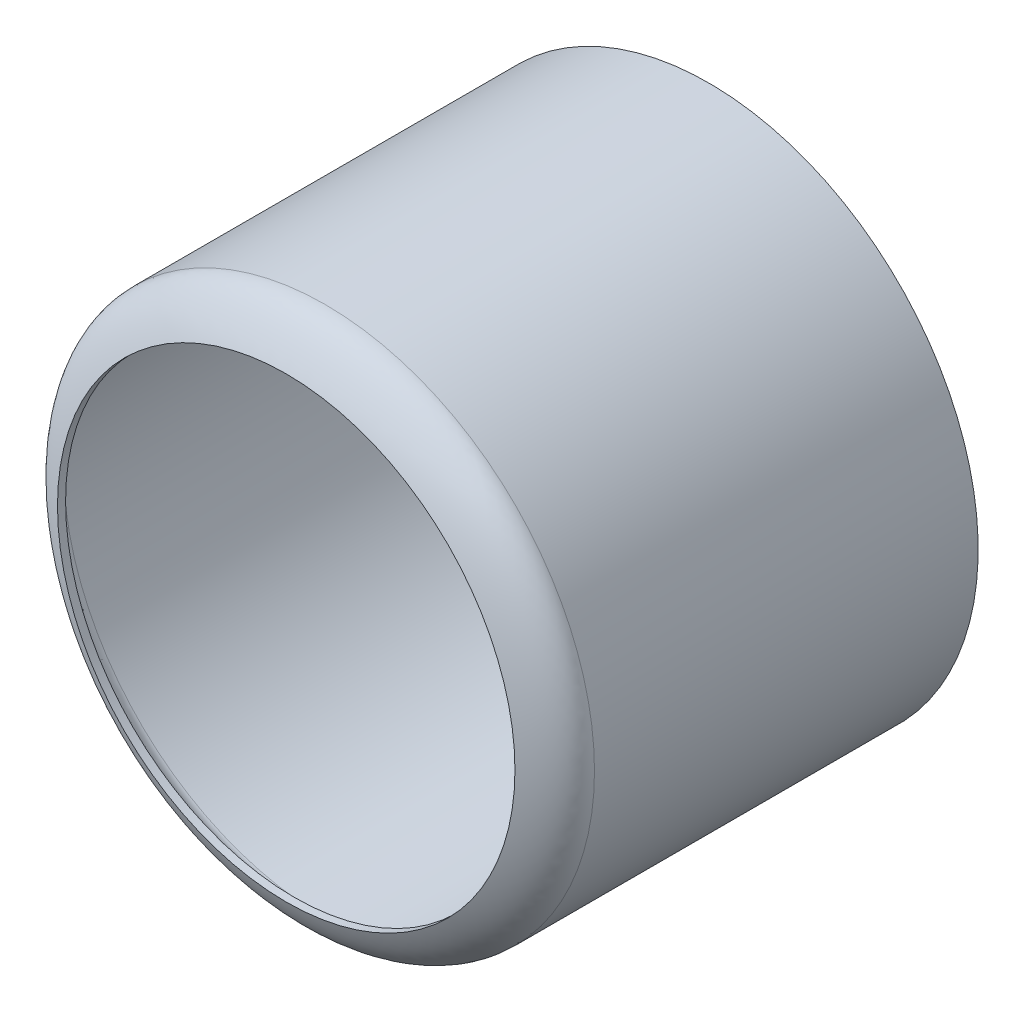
ISO-10303-21;
HEADER;
FILE_DESCRIPTION(('STEP AP214'),'2;1');
FILE_NAME('part.step','',(''),(''),'','','');
FILE_SCHEMA(('AUTOMOTIVE_DESIGN { 1 0 10303 214 1 1 1 1 }'));
ENDSEC;
DATA;
#1=APPLICATION_CONTEXT('core data for automotive mechanical design processes');
#2=APPLICATION_PROTOCOL_DEFINITION('international standard','automotive_design',2000,#1);
#3=PRODUCT_CONTEXT('',#1,'mechanical');
#4=PRODUCT('Part','Part','',(#3));
#5=PRODUCT_RELATED_PRODUCT_CATEGORY('part','',(#4));
#6=PRODUCT_DEFINITION_FORMATION('','',#4);
#7=PRODUCT_DEFINITION_CONTEXT('part definition',#1,'design');
#8=PRODUCT_DEFINITION('design','',#6,#7);
#9=PRODUCT_DEFINITION_SHAPE('','',#8);
#10=(LENGTH_UNIT() NAMED_UNIT(*) SI_UNIT(.MILLI.,.METRE.));
#11=(NAMED_UNIT(*) PLANE_ANGLE_UNIT() SI_UNIT($,.RADIAN.));
#12=(NAMED_UNIT(*) SI_UNIT($,.STERADIAN.) SOLID_ANGLE_UNIT());
#13=UNCERTAINTY_MEASURE_WITH_UNIT(LENGTH_MEASURE(1.E-05),#10,'distance_accuracy_value','');
#14=(GEOMETRIC_REPRESENTATION_CONTEXT(3) GLOBAL_UNCERTAINTY_ASSIGNED_CONTEXT((#13)) GLOBAL_UNIT_ASSIGNED_CONTEXT((#10,
#11,#12)) REPRESENTATION_CONTEXT('',''));
#15=CARTESIAN_POINT('',(0.,0.,0.));
#16=DIRECTION('',(0.,0.,1.));
#17=DIRECTION('',(1.,0.,0.));
#18=AXIS2_PLACEMENT_3D('',#15,#16,#17);
#19=CARTESIAN_POINT('',(0.,0.,26.));
#20=DIRECTION('',(0.,0.,-1.));
#21=DIRECTION('',(-1.,0.,0.));
#22=AXIS2_PLACEMENT_3D('',#19,#20,#21);
#23=CYLINDRICAL_SURFACE('',#22,18.25);
#24=CARTESIAN_POINT('',(0.,0.,26.));
#25=DIRECTION('',(0.,0.,1.));
#26=DIRECTION('',(1.,0.,0.));
#27=AXIS2_PLACEMENT_3D('',#24,#25,#26);
#28=CIRCLE('',#27,18.25);
#29=CARTESIAN_POINT('',(-18.25,0.,26.));
#30=VERTEX_POINT('',#29);
#31=EDGE_CURVE('E10',#30,#30,#28,.T.);
#32=CARTESIAN_POINT('',(0.,0.,0.));
#33=DIRECTION('',(0.,0.,1.));
#34=DIRECTION('',(1.,0.,0.));
#35=AXIS2_PLACEMENT_3D('',#32,#33,#34);
#36=CIRCLE('',#35,18.25);
#37=CARTESIAN_POINT('',(-18.25,0.,0.));
#38=VERTEX_POINT('',#37);
#39=EDGE_CURVE('E38',#38,#38,#36,.T.);
#40=CARTESIAN_POINT('',(-18.25,0.,26.));
#41=CARTESIAN_POINT('',(-18.25,0.,25.7291666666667));
#42=CARTESIAN_POINT('',(-18.25,0.,25.4583333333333));
#43=CARTESIAN_POINT('',(-18.25,0.,24.9166666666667));
#44=CARTESIAN_POINT('',(-18.25,0.,24.6458333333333));
#45=CARTESIAN_POINT('',(-18.25,0.,24.1041666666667));
#46=CARTESIAN_POINT('',(-18.25,0.,23.8333333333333));
#47=CARTESIAN_POINT('',(-18.25,0.,23.2916666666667));
#48=CARTESIAN_POINT('',(-18.25,0.,23.0208333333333));
#49=CARTESIAN_POINT('',(-18.25,0.,22.4791666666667));
#50=CARTESIAN_POINT('',(-18.25,0.,22.2083333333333));
#51=CARTESIAN_POINT('',(-18.25,0.,21.6666666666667));
#52=CARTESIAN_POINT('',(-18.25,0.,21.3958333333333));
#53=CARTESIAN_POINT('',(-18.25,0.,20.8541666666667));
#54=CARTESIAN_POINT('',(-18.25,0.,20.5833333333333));
#55=CARTESIAN_POINT('',(-18.25,0.,20.0416666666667));
#56=CARTESIAN_POINT('',(-18.25,0.,19.7708333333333));
#57=CARTESIAN_POINT('',(-18.25,0.,19.2291666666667));
#58=CARTESIAN_POINT('',(-18.25,0.,18.9583333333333));
#59=CARTESIAN_POINT('',(-18.25,0.,18.4166666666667));
#60=CARTESIAN_POINT('',(-18.25,0.,18.1458333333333));
#61=CARTESIAN_POINT('',(-18.25,0.,17.6041666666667));
#62=CARTESIAN_POINT('',(-18.25,0.,17.3333333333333));
#63=CARTESIAN_POINT('',(-18.25,0.,16.7916666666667));
#64=CARTESIAN_POINT('',(-18.25,0.,16.5208333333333));
#65=CARTESIAN_POINT('',(-18.25,0.,15.9791666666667));
#66=CARTESIAN_POINT('',(-18.25,0.,15.7083333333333));
#67=CARTESIAN_POINT('',(-18.25,0.,15.1666666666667));
#68=CARTESIAN_POINT('',(-18.25,0.,14.8958333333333));
#69=CARTESIAN_POINT('',(-18.25,0.,14.3541666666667));
#70=CARTESIAN_POINT('',(-18.25,0.,14.0833333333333));
#71=CARTESIAN_POINT('',(-18.25,0.,13.5416666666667));
#72=CARTESIAN_POINT('',(-18.25,0.,13.2708333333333));
#73=CARTESIAN_POINT('',(-18.25,0.,12.7291666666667));
#74=CARTESIAN_POINT('',(-18.25,0.,12.4583333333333));
#75=CARTESIAN_POINT('',(-18.25,0.,11.9166666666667));
#76=CARTESIAN_POINT('',(-18.25,0.,11.6458333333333));
#77=CARTESIAN_POINT('',(-18.25,0.,11.1041666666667));
#78=CARTESIAN_POINT('',(-18.25,0.,10.8333333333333));
#79=CARTESIAN_POINT('',(-18.25,0.,10.2916666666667));
#80=CARTESIAN_POINT('',(-18.25,0.,10.0208333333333));
#81=CARTESIAN_POINT('',(-18.25,0.,9.47916666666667));
#82=CARTESIAN_POINT('',(-18.25,0.,9.20833333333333));
#83=CARTESIAN_POINT('',(-18.25,0.,8.66666666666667));
#84=CARTESIAN_POINT('',(-18.25,0.,8.39583333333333));
#85=CARTESIAN_POINT('',(-18.25,0.,7.85416666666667));
#86=CARTESIAN_POINT('',(-18.25,0.,7.58333333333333));
#87=CARTESIAN_POINT('',(-18.25,0.,7.04166666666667));
#88=CARTESIAN_POINT('',(-18.25,0.,6.77083333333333));
#89=CARTESIAN_POINT('',(-18.25,0.,6.22916666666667));
#90=CARTESIAN_POINT('',(-18.25,0.,5.95833333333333));
#91=CARTESIAN_POINT('',(-18.25,0.,5.41666666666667));
#92=CARTESIAN_POINT('',(-18.25,0.,5.14583333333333));
#93=CARTESIAN_POINT('',(-18.25,0.,4.60416666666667));
#94=CARTESIAN_POINT('',(-18.25,0.,4.33333333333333));
#95=CARTESIAN_POINT('',(-18.25,0.,3.79166666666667));
#96=CARTESIAN_POINT('',(-18.25,0.,3.52083333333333));
#97=CARTESIAN_POINT('',(-18.25,0.,2.97916666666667));
#98=CARTESIAN_POINT('',(-18.25,0.,2.70833333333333));
#99=CARTESIAN_POINT('',(-18.25,0.,2.16666666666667));
#100=CARTESIAN_POINT('',(-18.25,0.,1.89583333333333));
#101=CARTESIAN_POINT('',(-18.25,0.,1.35416666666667));
#102=CARTESIAN_POINT('',(-18.25,0.,1.08333333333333));
#103=CARTESIAN_POINT('',(-18.25,0.,0.541666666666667));
#104=CARTESIAN_POINT('',(-18.25,0.,0.270833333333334));
#105=CARTESIAN_POINT('',(-18.25,0.,0.));
#106=B_SPLINE_CURVE_WITH_KNOTS('',3,(#40,#41,#42,#43,#44,#45,#46,#47,#48,#49,#50,#51,#52,#53,
#54,#55,#56,#57,#58,#59,#60,#61,#62,#63,#64,#65,#66,#67,#68,#69,#70,#71,#72,#73,#74,#75,#76,#77,
#78,#79,#80,#81,#82,#83,#84,#85,#86,#87,#88,#89,#90,#91,#92,#93,#94,#95,#96,#97,#98,#99,#100,
#101,#102,#103,#104,#105),.UNSPECIFIED.,.F.,.F.,(4,2,2,2,2,2,2,2,2,2,2,2,2,2,2,2,2,2,2,2,2,2,2,
2,2,2,2,2,2,2,2,2,4),(0.,0.812500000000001,1.625,2.4375,3.25,4.0625,4.875,5.6875,6.5,7.3125,
8.125,8.9375,9.75,10.5625,11.375,12.1875,13.,13.8125,14.625,15.4375,16.25,17.0625,17.875,
18.6875,19.5,20.3125,21.125,21.9375,22.75,23.5625,24.375,25.1875,26.),.UNSPECIFIED.);
#107=EDGE_CURVE('BSEAM30',#30,#38,#106,.T.);
#108=ORIENTED_EDGE('',*,*,#31,.F.);
#109=ORIENTED_EDGE('',*,*,#39,.T.);
#110=ORIENTED_EDGE('',*,*,#107,.T.);
#111=ORIENTED_EDGE('',*,*,#107,.F.);
#112=EDGE_LOOP('',(#108,#110,#109,#111));
#113=FACE_BOUND('',#112,.T.);
#114=ADVANCED_FACE('F30',(#113),#23,.T.);
#115=CARTESIAN_POINT('',(0.,0.,26.));
#116=DIRECTION('',(0.,1.,0.));
#117=DIRECTION('',(1.,0.,0.));
#118=AXIS2_PLACEMENT_3D('',#115,#116,#117);
#119=ELLIPSE('',#118,18.25,5.);
#120=TRIMMED_CURVE('',#119,(PARAMETER_VALUE(4.71238898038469)),
(PARAMETER_VALUE(7.85398163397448)),.T.,.PARAMETER.);
#121=CARTESIAN_POINT('',(0.,0.,21.));
#122=DIRECTION('',(0.,0.,1.));
#123=AXIS1_PLACEMENT('',#121,#122);
#124=SURFACE_OF_REVOLUTION('',#120,#123);
#125=CARTESIAN_POINT('',(0.,0.,28.6394313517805));
#126=DIRECTION('',(0.,0.,1.));
#127=DIRECTION('',(1.,0.,0.));
#128=AXIS2_PLACEMENT_3D('',#125,#126,#127);
#129=CIRCLE('',#128,15.5);
#130=CARTESIAN_POINT('',(15.5,0.,28.6394313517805));
#131=VERTEX_POINT('',#130);
#132=EDGE_CURVE('E74',#131,#131,#129,.T.);
#133=ORIENTED_EDGE('',*,*,#132,.F.);
#134=EDGE_LOOP('',(#133));
#135=FACE_BOUND('',#134,.T.);
#136=ORIENTED_EDGE('',*,*,#31,.T.);
#137=EDGE_LOOP('',(#136));
#138=FACE_BOUND('',#137,.T.);
#139=ADVANCED_FACE('F32',(#135,#138),#124,.F.);
#140=CARTESIAN_POINT('',(0.,0.,0.));
#141=DIRECTION('',(0.,0.,1.));
#142=DIRECTION('',(1.,0.,0.));
#143=AXIS2_PLACEMENT_3D('',#140,#141,#142);
#144=PLANE('',#143);
#145=CARTESIAN_POINT('',(0.,0.,0.));
#146=DIRECTION('',(0.,0.,1.));
#147=DIRECTION('',(1.,0.,0.));
#148=AXIS2_PLACEMENT_3D('',#145,#146,#147);
#149=CIRCLE('',#148,17.75);
#150=CARTESIAN_POINT('',(-17.75,0.,0.));
#151=VERTEX_POINT('',#150);
#152=EDGE_CURVE('E49',#151,#151,#149,.T.);
#153=ORIENTED_EDGE('',*,*,#152,.T.);
#154=EDGE_LOOP('',(#153));
#155=FACE_BOUND('',#154,.T.);
#156=ORIENTED_EDGE('',*,*,#39,.F.);
#157=EDGE_LOOP('',(#156));
#158=FACE_BOUND('',#157,.T.);
#159=ADVANCED_FACE('F57',(#155,#158),#144,.F.);
#160=CARTESIAN_POINT('',(0.,0.,26.));
#161=DIRECTION('',(0.,0.,-1.));
#162=DIRECTION('',(-1.,0.,0.));
#163=AXIS2_PLACEMENT_3D('',#160,#161,#162);
#164=CYLINDRICAL_SURFACE('',#163,17.75);
#165=CARTESIAN_POINT('',(0.,0.,26.));
#166=DIRECTION('',(0.,0.,1.));
#167=DIRECTION('',(1.,0.,0.));
#168=AXIS2_PLACEMENT_3D('',#165,#166,#167);
#169=CIRCLE('',#168,17.75);
#170=CARTESIAN_POINT('',(-17.75,0.,26.));
#171=VERTEX_POINT('',#170);
#172=EDGE_CURVE('E43',#171,#171,#169,.T.);
#173=CARTESIAN_POINT('',(-17.75,0.,26.));
#174=CARTESIAN_POINT('',(-17.75,0.,25.7291666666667));
#175=CARTESIAN_POINT('',(-17.75,0.,25.4583333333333));
#176=CARTESIAN_POINT('',(-17.75,0.,24.9166666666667));
#177=CARTESIAN_POINT('',(-17.75,0.,24.6458333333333));
#178=CARTESIAN_POINT('',(-17.75,0.,24.1041666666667));
#179=CARTESIAN_POINT('',(-17.75,0.,23.8333333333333));
#180=CARTESIAN_POINT('',(-17.75,0.,23.2916666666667));
#181=CARTESIAN_POINT('',(-17.75,0.,23.0208333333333));
#182=CARTESIAN_POINT('',(-17.75,0.,22.4791666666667));
#183=CARTESIAN_POINT('',(-17.75,0.,22.2083333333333));
#184=CARTESIAN_POINT('',(-17.75,0.,21.6666666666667));
#185=CARTESIAN_POINT('',(-17.75,0.,21.3958333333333));
#186=CARTESIAN_POINT('',(-17.75,0.,20.8541666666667));
#187=CARTESIAN_POINT('',(-17.75,0.,20.5833333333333));
#188=CARTESIAN_POINT('',(-17.75,0.,20.0416666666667));
#189=CARTESIAN_POINT('',(-17.75,0.,19.7708333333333));
#190=CARTESIAN_POINT('',(-17.75,0.,19.2291666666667));
#191=CARTESIAN_POINT('',(-17.75,0.,18.9583333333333));
#192=CARTESIAN_POINT('',(-17.75,0.,18.4166666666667));
#193=CARTESIAN_POINT('',(-17.75,0.,18.1458333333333));
#194=CARTESIAN_POINT('',(-17.75,0.,17.6041666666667));
#195=CARTESIAN_POINT('',(-17.75,0.,17.3333333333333));
#196=CARTESIAN_POINT('',(-17.75,0.,16.7916666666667));
#197=CARTESIAN_POINT('',(-17.75,0.,16.5208333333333));
#198=CARTESIAN_POINT('',(-17.75,0.,15.9791666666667));
#199=CARTESIAN_POINT('',(-17.75,0.,15.7083333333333));
#200=CARTESIAN_POINT('',(-17.75,0.,15.1666666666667));
#201=CARTESIAN_POINT('',(-17.75,0.,14.8958333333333));
#202=CARTESIAN_POINT('',(-17.75,0.,14.3541666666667));
#203=CARTESIAN_POINT('',(-17.75,0.,14.0833333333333));
#204=CARTESIAN_POINT('',(-17.75,0.,13.5416666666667));
#205=CARTESIAN_POINT('',(-17.75,0.,13.2708333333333));
#206=CARTESIAN_POINT('',(-17.75,0.,12.7291666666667));
#207=CARTESIAN_POINT('',(-17.75,0.,12.4583333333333));
#208=CARTESIAN_POINT('',(-17.75,0.,11.9166666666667));
#209=CARTESIAN_POINT('',(-17.75,0.,11.6458333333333));
#210=CARTESIAN_POINT('',(-17.75,0.,11.1041666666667));
#211=CARTESIAN_POINT('',(-17.75,0.,10.8333333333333));
#212=CARTESIAN_POINT('',(-17.75,0.,10.2916666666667));
#213=CARTESIAN_POINT('',(-17.75,0.,10.0208333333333));
#214=CARTESIAN_POINT('',(-17.75,0.,9.47916666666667));
#215=CARTESIAN_POINT('',(-17.75,0.,9.20833333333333));
#216=CARTESIAN_POINT('',(-17.75,0.,8.66666666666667));
#217=CARTESIAN_POINT('',(-17.75,0.,8.39583333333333));
#218=CARTESIAN_POINT('',(-17.75,0.,7.85416666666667));
#219=CARTESIAN_POINT('',(-17.75,0.,7.58333333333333));
#220=CARTESIAN_POINT('',(-17.75,0.,7.04166666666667));
#221=CARTESIAN_POINT('',(-17.75,0.,6.77083333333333));
#222=CARTESIAN_POINT('',(-17.75,0.,6.22916666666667));
#223=CARTESIAN_POINT('',(-17.75,0.,5.95833333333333));
#224=CARTESIAN_POINT('',(-17.75,0.,5.41666666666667));
#225=CARTESIAN_POINT('',(-17.75,0.,5.14583333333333));
#226=CARTESIAN_POINT('',(-17.75,0.,4.60416666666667));
#227=CARTESIAN_POINT('',(-17.75,0.,4.33333333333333));
#228=CARTESIAN_POINT('',(-17.75,0.,3.79166666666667));
#229=CARTESIAN_POINT('',(-17.75,0.,3.52083333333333));
#230=CARTESIAN_POINT('',(-17.75,0.,2.97916666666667));
#231=CARTESIAN_POINT('',(-17.75,0.,2.70833333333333));
#232=CARTESIAN_POINT('',(-17.75,0.,2.16666666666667));
#233=CARTESIAN_POINT('',(-17.75,0.,1.89583333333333));
#234=CARTESIAN_POINT('',(-17.75,0.,1.35416666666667));
#235=CARTESIAN_POINT('',(-17.75,0.,1.08333333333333));
#236=CARTESIAN_POINT('',(-17.75,0.,0.541666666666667));
#237=CARTESIAN_POINT('',(-17.75,0.,0.270833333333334));
#238=CARTESIAN_POINT('',(-17.75,0.,0.));
#239=B_SPLINE_CURVE_WITH_KNOTS('',3,(#173,#174,#175,#176,#177,#178,#179,#180,#181,#182,#183,
#184,#185,#186,#187,#188,#189,#190,#191,#192,#193,#194,#195,#196,#197,#198,#199,#200,#201,#202,
#203,#204,#205,#206,#207,#208,#209,#210,#211,#212,#213,#214,#215,#216,#217,#218,#219,#220,#221,
#222,#223,#224,#225,#226,#227,#228,#229,#230,#231,#232,#233,#234,#235,#236,#237,#238),
.UNSPECIFIED.,.F.,.F.,(4,2,2,2,2,2,2,2,2,2,2,2,2,2,2,2,2,2,2,2,2,2,2,2,2,2,2,2,2,2,2,2,4),(0.,
0.812499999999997,1.625,2.4375,3.25,4.0625,4.875,5.6875,6.5,7.3125,8.125,8.93749999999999,
9.74999999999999,10.5625,11.375,12.1875,13.,13.8125,14.625,15.4375,16.25,17.0625,17.875,18.6875,
19.5,20.3125,21.125,21.9375,22.75,23.5625,24.375,25.1875,26.),.UNSPECIFIED.);
#240=EDGE_CURVE('BSEAM59',#171,#151,#239,.T.);
#241=ORIENTED_EDGE('',*,*,#172,.T.);
#242=ORIENTED_EDGE('',*,*,#152,.F.);
#243=ORIENTED_EDGE('',*,*,#240,.T.);
#244=ORIENTED_EDGE('',*,*,#240,.F.);
#245=EDGE_LOOP('',(#241,#243,#242,#244));
#246=FACE_BOUND('',#245,.T.);
#247=ADVANCED_FACE('F59',(#246),#164,.F.);
#248=CARTESIAN_POINT('',(0.,0.,26.));
#249=DIRECTION('',(0.,1.,0.));
#250=DIRECTION('',(1.,0.,0.));
#251=AXIS2_PLACEMENT_3D('',#248,#249,#250);
#252=ELLIPSE('',#251,18.25,5.);
#253=TRIMMED_CURVE('',#252,(PARAMETER_VALUE(4.71238898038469)),
(PARAMETER_VALUE(7.85398163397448)),.T.,.PARAMETER.);
#254=CARTESIAN_POINT('',(0.,0.,21.));
#255=DIRECTION('',(0.,0.,1.));
#256=AXIS1_PLACEMENT('',#254,#255);
#257=SURFACE_OF_REVOLUTION('',#253,#256);
#258=OFFSET_SURFACE('',#257,0.5,.F.);
#259=CARTESIAN_POINT('',(0.,0.,28.0907693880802));
#260=DIRECTION('',(0.,0.,1.));
#261=DIRECTION('',(1.,0.,0.));
#262=AXIS2_PLACEMENT_3D('',#259,#260,#261);
#263=CIRCLE('',#262,15.5);
#264=CARTESIAN_POINT('',(15.5,0.,28.0907693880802));
#265=VERTEX_POINT('',#264);
#266=EDGE_CURVE('E35',#265,#265,#263,.T.);
#267=ORIENTED_EDGE('',*,*,#266,.T.);
#268=EDGE_LOOP('',(#267));
#269=FACE_BOUND('',#268,.T.);
#270=ORIENTED_EDGE('',*,*,#172,.F.);
#271=EDGE_LOOP('',(#270));
#272=FACE_BOUND('',#271,.T.);
#273=ADVANCED_FACE('F55',(#269,#272),#258,.T.);
#274=CARTESIAN_POINT('',(0.,0.,31.));
#275=DIRECTION('',(0.,0.,-1.));
#276=DIRECTION('',(-1.,0.,0.));
#277=AXIS2_PLACEMENT_3D('',#274,#275,#276);
#278=CYLINDRICAL_SURFACE('',#277,15.5);
#279=ORIENTED_EDGE('',*,*,#132,.T.);
#280=EDGE_LOOP('',(#279));
#281=FACE_BOUND('',#280,.T.);
#282=ORIENTED_EDGE('',*,*,#266,.F.);
#283=EDGE_LOOP('',(#282));
#284=FACE_BOUND('',#283,.T.);
#285=ADVANCED_FACE('F85',(#281,#284),#278,.F.);
#286=CLOSED_SHELL('',(#114,#139,#159,#247,#273,#285));
#287=MANIFOLD_SOLID_BREP('B2',#286);
#288=ADVANCED_BREP_SHAPE_REPRESENTATION('',(#18,#287),#14);
#289=SHAPE_DEFINITION_REPRESENTATION(#9,#288);
ENDSEC;
END-ISO-10303-21;
